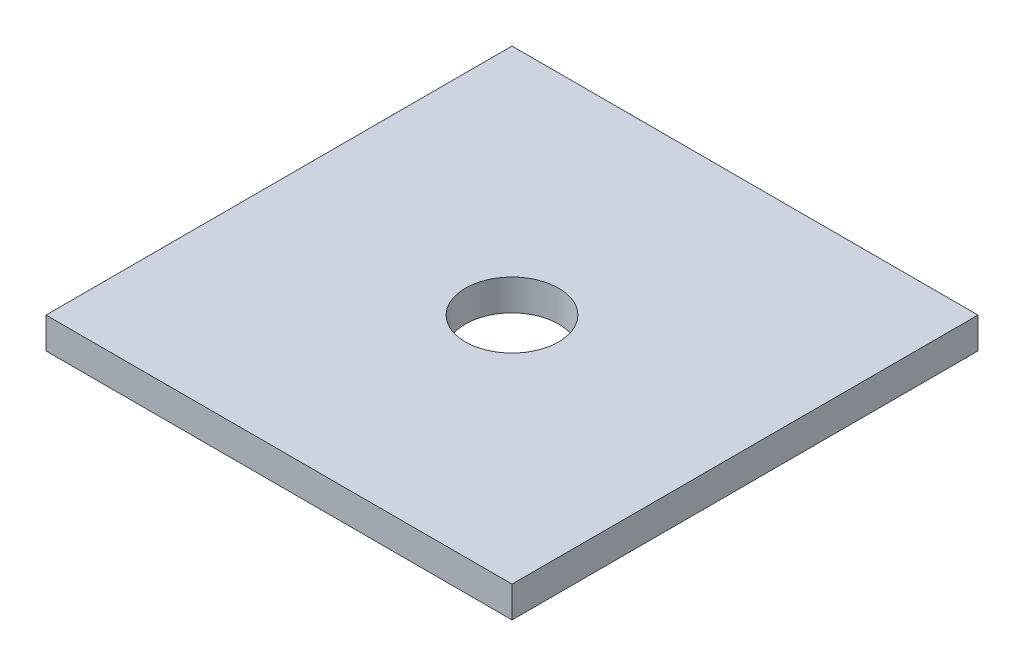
ISO-10303-21;
HEADER;
FILE_DESCRIPTION(('STEP AP214'),'2;1');
FILE_NAME('part.step','',(''),(''),'','','');
FILE_SCHEMA(('AUTOMOTIVE_DESIGN { 1 0 10303 214 1 1 1 1 }'));
ENDSEC;
DATA;
#1=APPLICATION_CONTEXT('core data for automotive mechanical design processes');
#2=APPLICATION_PROTOCOL_DEFINITION('international standard','automotive_design',2000,#1);
#3=PRODUCT_CONTEXT('',#1,'mechanical');
#4=PRODUCT('Part','Part','',(#3));
#5=PRODUCT_RELATED_PRODUCT_CATEGORY('part','',(#4));
#6=PRODUCT_DEFINITION_FORMATION('','',#4);
#7=PRODUCT_DEFINITION_CONTEXT('part definition',#1,'design');
#8=PRODUCT_DEFINITION('design','',#6,#7);
#9=PRODUCT_DEFINITION_SHAPE('','',#8);
#10=(LENGTH_UNIT() NAMED_UNIT(*) SI_UNIT(.MILLI.,.METRE.));
#11=(NAMED_UNIT(*) PLANE_ANGLE_UNIT() SI_UNIT($,.RADIAN.));
#12=(NAMED_UNIT(*) SI_UNIT($,.STERADIAN.) SOLID_ANGLE_UNIT());
#13=UNCERTAINTY_MEASURE_WITH_UNIT(LENGTH_MEASURE(1.E-05),#10,'distance_accuracy_value','');
#14=(GEOMETRIC_REPRESENTATION_CONTEXT(3) GLOBAL_UNCERTAINTY_ASSIGNED_CONTEXT((#13)) GLOBAL_UNIT_ASSIGNED_CONTEXT((#10,
#11,#12)) REPRESENTATION_CONTEXT('',''));
#15=CARTESIAN_POINT('',(0.,0.,0.));
#16=DIRECTION('',(0.,0.,1.));
#17=DIRECTION('',(1.,0.,0.));
#18=AXIS2_PLACEMENT_3D('',#15,#16,#17);
#19=CARTESIAN_POINT('',(0.,3.,-45.));
#20=DIRECTION('',(0.,-1.,0.));
#21=DIRECTION('',(0.,0.,-1.));
#22=AXIS2_PLACEMENT_3D('',#19,#20,#21);
#23=PLANE('',#22);
#24=DIRECTION('',(0.,0.,1.));
#25=VECTOR('',#24,1.);
#26=CARTESIAN_POINT('',(0.,3.,0.));
#27=LINE('',#26,#25);
#28=CARTESIAN_POINT('',(0.,3.,-45.));
#29=VERTEX_POINT('',#28);
#30=CARTESIAN_POINT('',(0.,3.,0.));
#31=VERTEX_POINT('',#30);
#32=EDGE_CURVE('E83',#29,#31,#27,.T.);
#33=ORIENTED_EDGE('',*,*,#32,.T.);
#34=DIRECTION('',(1.,0.,0.));
#35=VECTOR('',#34,1.);
#36=CARTESIAN_POINT('',(0.,3.,0.));
#37=LINE('',#36,#35);
#38=CARTESIAN_POINT('',(45.,3.,0.));
#39=VERTEX_POINT('',#38);
#40=EDGE_CURVE('E78',#31,#39,#37,.T.);
#41=ORIENTED_EDGE('',*,*,#40,.T.);
#42=DIRECTION('',(0.,0.,-1.));
#43=VECTOR('',#42,1.);
#44=CARTESIAN_POINT('',(45.,3.,0.));
#45=LINE('',#44,#43);
#46=CARTESIAN_POINT('',(45.,3.,-45.));
#47=VERTEX_POINT('',#46);
#48=EDGE_CURVE('E81',#39,#47,#45,.T.);
#49=ORIENTED_EDGE('',*,*,#48,.T.);
#50=DIRECTION('',(-1.,0.,0.));
#51=VECTOR('',#50,1.);
#52=CARTESIAN_POINT('',(0.,3.,-45.));
#53=LINE('',#52,#51);
#54=EDGE_CURVE('E48',#47,#29,#53,.T.);
#55=ORIENTED_EDGE('',*,*,#54,.T.);
#56=EDGE_LOOP('',(#33,#41,#49,#55));
#57=FACE_BOUND('',#56,.T.);
#58=CARTESIAN_POINT('',(22.5,3.,-22.5));
#59=DIRECTION('',(0.,1.,0.));
#60=DIRECTION('',(0.,0.,1.));
#61=AXIS2_PLACEMENT_3D('',#58,#59,#60);
#62=CIRCLE('',#61,4.5);
#63=CARTESIAN_POINT('',(22.5,3.,-18.));
#64=VERTEX_POINT('',#63);
#65=EDGE_CURVE('E98',#64,#64,#62,.T.);
#66=ORIENTED_EDGE('',*,*,#65,.F.);
#67=EDGE_LOOP('',(#66));
#68=FACE_BOUND('',#67,.T.);
#69=ADVANCED_FACE('F31',(#57,#68),#23,.F.);
#70=CARTESIAN_POINT('',(0.,0.,-45.));
#71=DIRECTION('',(0.,-1.,0.));
#72=DIRECTION('',(0.,0.,-1.));
#73=AXIS2_PLACEMENT_3D('',#70,#71,#72);
#74=PLANE('',#73);
#75=DIRECTION('',(0.,0.,1.));
#76=VECTOR('',#75,1.);
#77=CARTESIAN_POINT('',(0.,0.,0.));
#78=LINE('',#77,#76);
#79=CARTESIAN_POINT('',(0.,0.,-45.));
#80=VERTEX_POINT('',#79);
#81=CARTESIAN_POINT('',(0.,0.,0.));
#82=VERTEX_POINT('',#81);
#83=EDGE_CURVE('E95',#80,#82,#78,.T.);
#84=ORIENTED_EDGE('',*,*,#83,.F.);
#85=DIRECTION('',(-1.,0.,0.));
#86=VECTOR('',#85,1.);
#87=CARTESIAN_POINT('',(0.,0.,-45.));
#88=LINE('',#87,#86);
#89=CARTESIAN_POINT('',(45.,0.,-45.));
#90=VERTEX_POINT('',#89);
#91=EDGE_CURVE('E71',#90,#80,#88,.T.);
#92=ORIENTED_EDGE('',*,*,#91,.F.);
#93=DIRECTION('',(0.,0.,-1.));
#94=VECTOR('',#93,1.);
#95=CARTESIAN_POINT('',(45.,0.,0.));
#96=LINE('',#95,#94);
#97=CARTESIAN_POINT('',(45.,0.,0.));
#98=VERTEX_POINT('',#97);
#99=EDGE_CURVE('E65',#98,#90,#96,.T.);
#100=ORIENTED_EDGE('',*,*,#99,.F.);
#101=DIRECTION('',(1.,0.,0.));
#102=VECTOR('',#101,1.);
#103=CARTESIAN_POINT('',(0.,0.,0.));
#104=LINE('',#103,#102);
#105=EDGE_CURVE('E87',#82,#98,#104,.T.);
#106=ORIENTED_EDGE('',*,*,#105,.F.);
#107=EDGE_LOOP('',(#84,#92,#100,#106));
#108=FACE_BOUND('',#107,.T.);
#109=CARTESIAN_POINT('',(22.5,0.,-22.5));
#110=DIRECTION('',(0.,1.,0.));
#111=DIRECTION('',(0.,0.,1.));
#112=AXIS2_PLACEMENT_3D('',#109,#110,#111);
#113=CIRCLE('',#112,4.5);
#114=CARTESIAN_POINT('',(22.5,0.,-18.));
#115=VERTEX_POINT('',#114);
#116=EDGE_CURVE('E110',#115,#115,#113,.T.);
#117=ORIENTED_EDGE('',*,*,#116,.T.);
#118=EDGE_LOOP('',(#117));
#119=FACE_BOUND('',#118,.T.);
#120=ADVANCED_FACE('F106',(#108,#119),#74,.T.);
#121=CARTESIAN_POINT('',(0.,3.,0.));
#122=DIRECTION('',(1.,0.,0.));
#123=DIRECTION('',(0.,0.,-1.));
#124=AXIS2_PLACEMENT_3D('',#121,#122,#123);
#125=PLANE('',#124);
#126=ORIENTED_EDGE('',*,*,#83,.T.);
#127=DIRECTION('',(0.,-1.,0.));
#128=VECTOR('',#127,1.);
#129=CARTESIAN_POINT('',(0.,3.,0.));
#130=LINE('',#129,#128);
#131=EDGE_CURVE('E11',#31,#82,#130,.T.);
#132=ORIENTED_EDGE('',*,*,#131,.F.);
#133=ORIENTED_EDGE('',*,*,#32,.F.);
#134=DIRECTION('',(0.,-1.,0.));
#135=VECTOR('',#134,1.);
#136=CARTESIAN_POINT('',(0.,3.,-45.));
#137=LINE('',#136,#135);
#138=EDGE_CURVE('E91',#29,#80,#137,.T.);
#139=ORIENTED_EDGE('',*,*,#138,.T.);
#140=EDGE_LOOP('',(#126,#132,#133,#139));
#141=FACE_BOUND('',#140,.T.);
#142=ADVANCED_FACE('F33',(#141),#125,.F.);
#143=CARTESIAN_POINT('',(0.,3.,0.));
#144=DIRECTION('',(0.,0.,-1.));
#145=DIRECTION('',(-1.,0.,0.));
#146=AXIS2_PLACEMENT_3D('',#143,#144,#145);
#147=PLANE('',#146);
#148=ORIENTED_EDGE('',*,*,#105,.T.);
#149=DIRECTION('',(0.,-1.,0.));
#150=VECTOR('',#149,1.);
#151=CARTESIAN_POINT('',(45.,3.,0.));
#152=LINE('',#151,#150);
#153=EDGE_CURVE('E40',#39,#98,#152,.T.);
#154=ORIENTED_EDGE('',*,*,#153,.F.);
#155=ORIENTED_EDGE('',*,*,#40,.F.);
#156=ORIENTED_EDGE('',*,*,#131,.T.);
#157=EDGE_LOOP('',(#148,#154,#155,#156));
#158=FACE_BOUND('',#157,.T.);
#159=ADVANCED_FACE('F86',(#158),#147,.F.);
#160=CARTESIAN_POINT('',(45.,3.,0.));
#161=DIRECTION('',(-1.,0.,0.));
#162=DIRECTION('',(0.,0.,1.));
#163=AXIS2_PLACEMENT_3D('',#160,#161,#162);
#164=PLANE('',#163);
#165=ORIENTED_EDGE('',*,*,#99,.T.);
#166=DIRECTION('',(0.,-1.,0.));
#167=VECTOR('',#166,1.);
#168=CARTESIAN_POINT('',(45.,3.,-45.));
#169=LINE('',#168,#167);
#170=EDGE_CURVE('E88',#47,#90,#169,.T.);
#171=ORIENTED_EDGE('',*,*,#170,.F.);
#172=ORIENTED_EDGE('',*,*,#48,.F.);
#173=ORIENTED_EDGE('',*,*,#153,.T.);
#174=EDGE_LOOP('',(#165,#171,#172,#173));
#175=FACE_BOUND('',#174,.T.);
#176=ADVANCED_FACE('F89',(#175),#164,.F.);
#177=CARTESIAN_POINT('',(0.,3.,-45.));
#178=DIRECTION('',(0.,0.,1.));
#179=DIRECTION('',(1.,0.,0.));
#180=AXIS2_PLACEMENT_3D('',#177,#178,#179);
#181=PLANE('',#180);
#182=ORIENTED_EDGE('',*,*,#91,.T.);
#183=ORIENTED_EDGE('',*,*,#138,.F.);
#184=ORIENTED_EDGE('',*,*,#54,.F.);
#185=ORIENTED_EDGE('',*,*,#170,.T.);
#186=EDGE_LOOP('',(#182,#183,#184,#185));
#187=FACE_BOUND('',#186,.T.);
#188=ADVANCED_FACE('F103',(#187),#181,.F.);
#189=CARTESIAN_POINT('',(22.5,3.,-22.5));
#190=DIRECTION('',(0.,-1.,0.));
#191=DIRECTION('',(0.,0.,-1.));
#192=AXIS2_PLACEMENT_3D('',#189,#190,#191);
#193=CYLINDRICAL_SURFACE('',#192,4.5);
#194=ORIENTED_EDGE('',*,*,#65,.T.);
#195=EDGE_LOOP('',(#194));
#196=FACE_BOUND('',#195,.T.);
#197=ORIENTED_EDGE('',*,*,#116,.F.);
#198=EDGE_LOOP('',(#197));
#199=FACE_BOUND('',#198,.T.);
#200=ADVANCED_FACE('F116',(#196,#199),#193,.F.);
#201=CLOSED_SHELL('',(#69,#120,#142,#159,#176,#188,#200));
#202=MANIFOLD_SOLID_BREP('B2',#201);
#203=ADVANCED_BREP_SHAPE_REPRESENTATION('',(#18,#202),#14);
#204=SHAPE_DEFINITION_REPRESENTATION(#9,#203);
ENDSEC;
END-ISO-10303-21;
